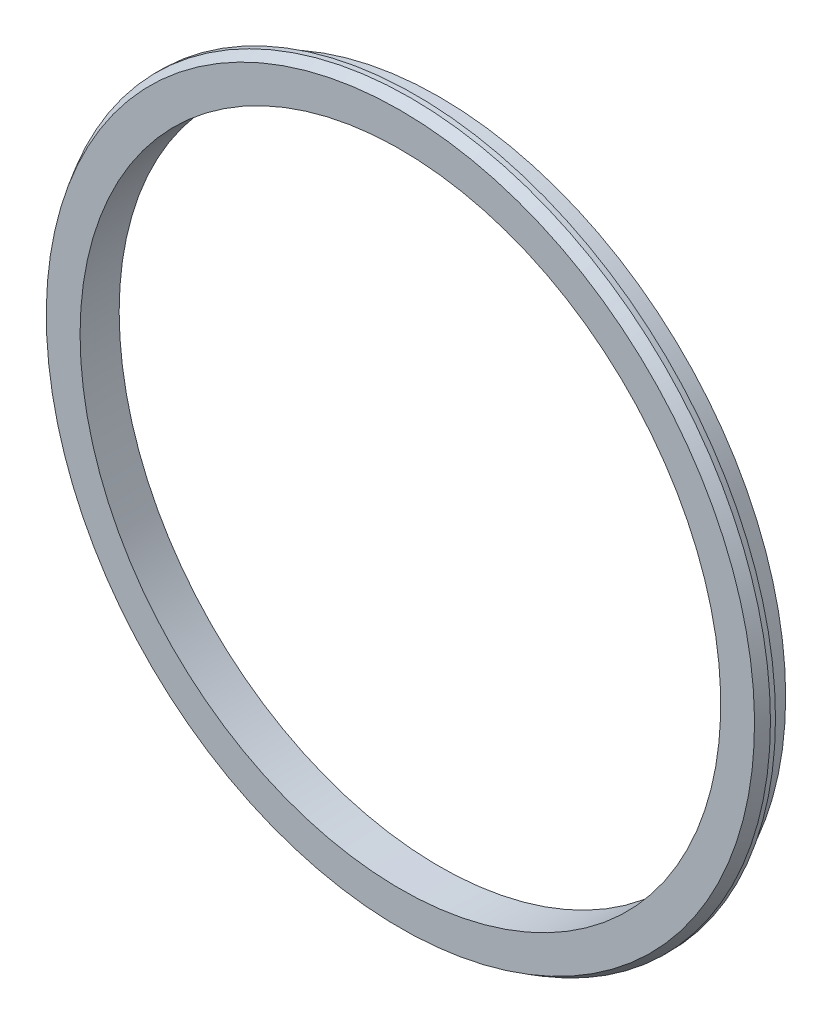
ISO-10303-21;
HEADER;
FILE_DESCRIPTION(('STEP AP214'),'2;1');
FILE_NAME('part.step','',(''),(''),'','','');
FILE_SCHEMA(('AUTOMOTIVE_DESIGN { 1 0 10303 214 1 1 1 1 }'));
ENDSEC;
DATA;
#1=APPLICATION_CONTEXT('core data for automotive mechanical design processes');
#2=APPLICATION_PROTOCOL_DEFINITION('international standard','automotive_design',2000,#1);
#3=PRODUCT_CONTEXT('',#1,'mechanical');
#4=PRODUCT('Part','Part','',(#3));
#5=PRODUCT_RELATED_PRODUCT_CATEGORY('part','',(#4));
#6=PRODUCT_DEFINITION_FORMATION('','',#4);
#7=PRODUCT_DEFINITION_CONTEXT('part definition',#1,'design');
#8=PRODUCT_DEFINITION('design','',#6,#7);
#9=PRODUCT_DEFINITION_SHAPE('','',#8);
#10=(LENGTH_UNIT() NAMED_UNIT(*) SI_UNIT(.MILLI.,.METRE.));
#11=(NAMED_UNIT(*) PLANE_ANGLE_UNIT() SI_UNIT($,.RADIAN.));
#12=(NAMED_UNIT(*) SI_UNIT($,.STERADIAN.) SOLID_ANGLE_UNIT());
#13=UNCERTAINTY_MEASURE_WITH_UNIT(LENGTH_MEASURE(1.E-05),#10,'distance_accuracy_value','');
#14=(GEOMETRIC_REPRESENTATION_CONTEXT(3) GLOBAL_UNCERTAINTY_ASSIGNED_CONTEXT((#13)) GLOBAL_UNIT_ASSIGNED_CONTEXT((#10,
#11,#12)) REPRESENTATION_CONTEXT('',''));
#15=CARTESIAN_POINT('',(0.,0.,0.));
#16=DIRECTION('',(0.,0.,1.));
#17=DIRECTION('',(1.,0.,0.));
#18=AXIS2_PLACEMENT_3D('',#15,#16,#17);
#19=CARTESIAN_POINT('',(0.,0.,27.4584));
#20=DIRECTION('',(0.,0.,-1.));
#21=DIRECTION('',(-1.,0.,0.));
#22=AXIS2_PLACEMENT_3D('',#19,#20,#21);
#23=CYLINDRICAL_SURFACE('',#22,63.5);
#24=CARTESIAN_POINT('',(0.,0.,27.4584));
#25=DIRECTION('',(0.,0.,-1.));
#26=DIRECTION('',(-1.,0.,0.));
#27=AXIS2_PLACEMENT_3D('',#24,#25,#26);
#28=CIRCLE('',#27,63.5);
#29=CARTESIAN_POINT('',(-63.5,0.,27.4584));
#30=VERTEX_POINT('',#29);
#31=EDGE_CURVE('E58',#30,#30,#28,.T.);
#32=ORIENTED_EDGE('',*,*,#31,.F.);
#33=EDGE_LOOP('',(#32));
#34=FACE_BOUND('',#33,.T.);
#35=CARTESIAN_POINT('',(0.,0.,19.7086));
#36=DIRECTION('',(0.,0.,-1.));
#37=DIRECTION('',(-1.,0.,0.));
#38=AXIS2_PLACEMENT_3D('',#35,#36,#37);
#39=CIRCLE('',#38,63.5);
#40=CARTESIAN_POINT('',(-63.5,0.,19.7086));
#41=VERTEX_POINT('',#40);
#42=EDGE_CURVE('E43',#41,#41,#39,.F.);
#43=ORIENTED_EDGE('',*,*,#42,.F.);
#44=EDGE_LOOP('',(#43));
#45=FACE_BOUND('',#44,.T.);
#46=ADVANCED_FACE('F39',(#34,#45),#23,.F.);
#47=CARTESIAN_POINT('',(0.,71.35,27.4584));
#48=DIRECTION('',(0.,0.,-1.));
#49=DIRECTION('',(-1.,0.,0.));
#50=AXIS2_PLACEMENT_3D('',#47,#48,#49);
#51=PLANE('',#50);
#52=ORIENTED_EDGE('',*,*,#31,.T.);
#53=EDGE_LOOP('',(#52));
#54=FACE_BOUND('',#53,.T.);
#55=CARTESIAN_POINT('',(0.,0.,27.4584));
#56=DIRECTION('',(0.,0.,-1.));
#57=DIRECTION('',(0.,1.,0.));
#58=AXIS2_PLACEMENT_3D('',#55,#56,#57);
#59=CIRCLE('',#58,70.1952994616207);
#60=CARTESIAN_POINT('',(0.,70.1952994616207,27.4584));
#61=VERTEX_POINT('',#60);
#62=EDGE_CURVE('E56',#61,#61,#59,.T.);
#63=ORIENTED_EDGE('',*,*,#62,.F.);
#64=EDGE_LOOP('',(#63));
#65=FACE_BOUND('',#64,.T.);
#66=ADVANCED_FACE('F41',(#54,#65),#51,.F.);
#67=CARTESIAN_POINT('',(0.,0.,25.4583999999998));
#68=DIRECTION('',(0.,0.,-1.));
#69=DIRECTION('',(0.,1.,0.));
#70=AXIS2_PLACEMENT_3D('',#67,#68,#69);
#71=CONICAL_SURFACE('',#70,71.35,0.523598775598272);
#72=CARTESIAN_POINT('',(0.,0.,25.4583999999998));
#73=DIRECTION('',(0.,0.,1.));
#74=DIRECTION('',(1.,0.,0.));
#75=AXIS2_PLACEMENT_3D('',#72,#73,#74);
#76=CIRCLE('',#75,71.35);
#77=CARTESIAN_POINT('',(71.35,0.,25.4583999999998));
#78=VERTEX_POINT('',#77);
#79=EDGE_CURVE('E52',#78,#78,#76,.F.);
#80=ORIENTED_EDGE('',*,*,#79,.F.);
#81=EDGE_LOOP('',(#80));
#82=FACE_BOUND('',#81,.T.);
#83=ORIENTED_EDGE('',*,*,#62,.T.);
#84=EDGE_LOOP('',(#83));
#85=FACE_BOUND('',#84,.T.);
#86=ADVANCED_FACE('F82',(#82,#85),#71,.T.);
#87=CARTESIAN_POINT('',(0.,0.,0.));
#88=DIRECTION('',(0.,0.,1.));
#89=DIRECTION('',(1.,0.,0.));
#90=AXIS2_PLACEMENT_3D('',#87,#88,#89);
#91=CYLINDRICAL_SURFACE('',#90,71.35);
#92=ORIENTED_EDGE('',*,*,#79,.T.);
#93=EDGE_LOOP('',(#92));
#94=FACE_BOUND('',#93,.T.);
#95=CARTESIAN_POINT('',(0.,0.,24.4584));
#96=DIRECTION('',(0.,0.,1.));
#97=DIRECTION('',(1.,0.,0.));
#98=AXIS2_PLACEMENT_3D('',#95,#96,#97);
#99=CIRCLE('',#98,71.35);
#100=CARTESIAN_POINT('',(71.35,0.,24.4584));
#101=VERTEX_POINT('',#100);
#102=EDGE_CURVE('E47',#101,#101,#99,.T.);
#103=ORIENTED_EDGE('',*,*,#102,.T.);
#104=EDGE_LOOP('',(#103));
#105=FACE_BOUND('',#104,.T.);
#106=ADVANCED_FACE('F92',(#94,#105),#91,.T.);
#107=CARTESIAN_POINT('',(0.,68.6181,24.4584));
#108=DIRECTION('',(0.,0.,1.));
#109=DIRECTION('',(1.,0.,0.));
#110=AXIS2_PLACEMENT_3D('',#107,#108,#109);
#111=PLANE('',#110);
#112=CARTESIAN_POINT('',(0.,0.,24.4584));
#113=DIRECTION('',(0.,0.,1.));
#114=DIRECTION('',(1.,0.,0.));
#115=AXIS2_PLACEMENT_3D('',#112,#113,#114);
#116=CIRCLE('',#115,68.6181);
#117=CARTESIAN_POINT('',(68.6181,0.,24.4584));
#118=VERTEX_POINT('',#117);
#119=EDGE_CURVE('E10',#118,#118,#116,.F.);
#120=ORIENTED_EDGE('',*,*,#119,.F.);
#121=EDGE_LOOP('',(#120));
#122=FACE_BOUND('',#121,.T.);
#123=ORIENTED_EDGE('',*,*,#102,.F.);
#124=EDGE_LOOP('',(#123));
#125=FACE_BOUND('',#124,.T.);
#126=ADVANCED_FACE('F86',(#122,#125),#111,.F.);
#127=CARTESIAN_POINT('',(0.,0.,0.));
#128=DIRECTION('',(0.,0.,1.));
#129=DIRECTION('',(1.,0.,0.));
#130=AXIS2_PLACEMENT_3D('',#127,#128,#129);
#131=CYLINDRICAL_SURFACE('',#130,68.6181);
#132=ORIENTED_EDGE('',*,*,#119,.T.);
#133=EDGE_LOOP('',(#132));
#134=FACE_BOUND('',#133,.T.);
#135=CARTESIAN_POINT('',(0.,0.,19.7086));
#136=DIRECTION('',(0.,0.,-1.));
#137=DIRECTION('',(-1.,0.,0.));
#138=AXIS2_PLACEMENT_3D('',#135,#136,#137);
#139=CIRCLE('',#138,68.6181);
#140=CARTESIAN_POINT('',(-68.6181,0.,19.7086));
#141=VERTEX_POINT('',#140);
#142=EDGE_CURVE('E63',#141,#141,#139,.F.);
#143=ORIENTED_EDGE('',*,*,#142,.T.);
#144=EDGE_LOOP('',(#143));
#145=FACE_BOUND('',#144,.T.);
#146=ADVANCED_FACE('F78',(#134,#145),#131,.T.);
#147=CARTESIAN_POINT('',(0.,71.35,19.7086));
#148=DIRECTION('',(0.,0.,-1.));
#149=DIRECTION('',(-1.,0.,0.));
#150=AXIS2_PLACEMENT_3D('',#147,#148,#149);
#151=PLANE('',#150);
#152=ORIENTED_EDGE('',*,*,#142,.F.);
#153=EDGE_LOOP('',(#152));
#154=FACE_BOUND('',#153,.T.);
#155=ORIENTED_EDGE('',*,*,#42,.T.);
#156=EDGE_LOOP('',(#155));
#157=FACE_BOUND('',#156,.T.);
#158=ADVANCED_FACE('F73',(#154,#157),#151,.T.);
#159=CLOSED_SHELL('',(#46,#66,#86,#106,#126,#146,#158));
#160=MANIFOLD_SOLID_BREP('B2',#159);
#161=ADVANCED_BREP_SHAPE_REPRESENTATION('',(#18,#160),#14);
#162=SHAPE_DEFINITION_REPRESENTATION(#9,#161);
ENDSEC;
END-ISO-10303-21;
